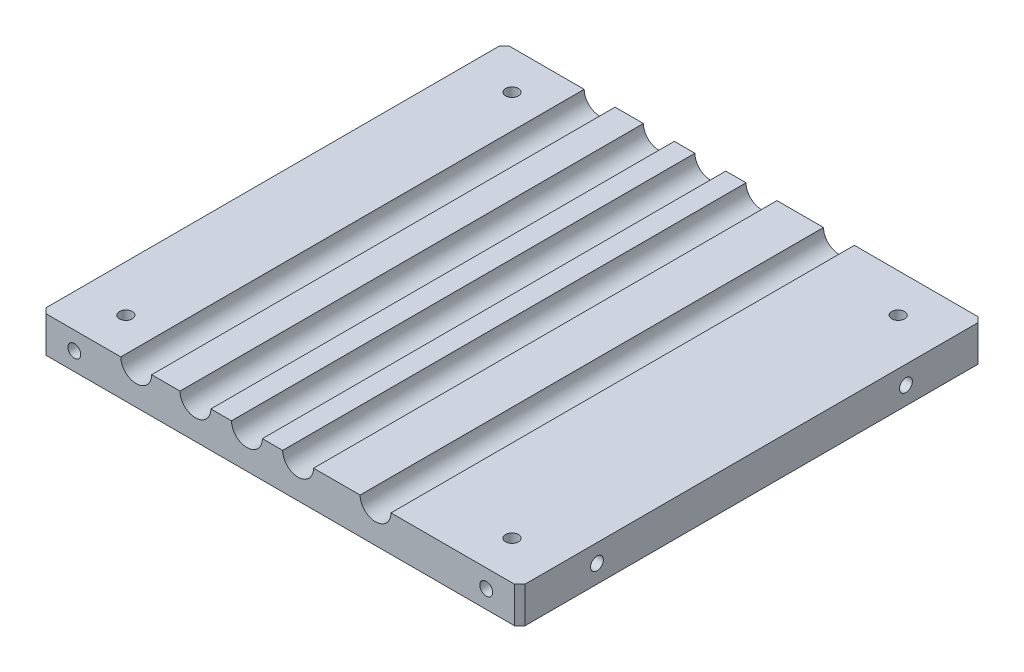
from build123d import *

# Parameters (mm, degrees)
SKETCH_1_W             = 93
SKETCH_1_H             = 90
EXTRUDE_1_DEPTH        = 7
CHAMFER_1_SIZE         = 1
SKETCH_2_R             = 3
CUT_EXTRUDE_1_DEPTH    = 102.544325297
HOLE_WIZARD_M3_1_D     = 2.5
HOLE_WIZARD_M3_2_D     = 2.5
HOLE_WIZARD_M3_2_DEPTH = 7.5
HOLE_WIZARD_M3_2_TIP   = 0.751075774
HOLE_WIZARD_M3_3_D     = 2.5
HOLE_WIZARD_M3_3_DEPTH = 7.5
HOLE_WIZARD_M3_3_TIP   = 0.751075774
HOLE_WIZARD_M3_5_D     = 2.5
HOLE_WIZARD_M3_5_DEPTH = 5
HOLE_WIZARD_M3_5_TIP   = 0.751075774
HOLE_WIZARD_M3_6_D     = 2.5
HOLE_WIZARD_M3_6_DEPTH = 6
HOLE_WIZARD_M3_6_TIP   = 0.751075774


with BuildPart() as part:
    # Sketch 1 → Extrude 1 (new body)
    with BuildSketch(Plane(origin=(0, 0, 0), x_dir=(1, 0, 0), z_dir=(0, 1, 0))):
        Rectangle(SKETCH_1_W, SKETCH_1_H)
    extrude(amount=EXTRUDE_1_DEPTH)

    # Chamfer 1
    chamfer_1_edges = [part.edges().sort_by_distance(p)[0] for p in [
        (46.5, 3.5, 45),
        (-46.5, 3.5, 45),
        (-46.5, 3.5, -45),
        (46.5, 3.5, -45),
    ]]
    chamfer(chamfer_1_edges, length=CHAMFER_1_SIZE)

    # Sketch 2 → Cut-Extrude 1 (cut, through all)
    with BuildSketch(Plane.XY.offset(45)):
        with Locations((18.493876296, 7)):
            Circle(SKETCH_2_R)
        with Locations((3.459690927, 6.983289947)):
            Circle(SKETCH_2_R)
        with Locations((-6.48, 7)):
            Circle(SKETCH_2_R)
        with Locations((-16.48, 7)):
            Circle(SKETCH_2_R)
        with Locations((-27.98, 7)):
            Circle(SKETCH_2_R)
    extrude(amount=-CUT_EXTRUDE_1_DEPTH, mode=Mode.SUBTRACT)

    # Hole Wizard M3 _1 (through all)
    with Locations(Plane(origin=(0, 0, 0), x_dir=(-1, 0, 0), z_dir=(0, -1, 0))):
        with Locations((37.5, 37.5), (-37.5, 37.5), (-37.5, -37.5), (37.5, -37.5)):
            Hole(HOLE_WIZARD_M3_1_D / 2)

    # Hole Wizard M3 _2
    with Locations(Plane(origin=(46.5, 0, 0), x_dir=(0, 0, -1), z_dir=(1, 0, 0))):
        with Locations((30, 3.5), (-30, 3.5)):
            Hole(HOLE_WIZARD_M3_2_D / 2, depth=HOLE_WIZARD_M3_2_DEPTH)
            with Locations((0, 0, -(HOLE_WIZARD_M3_2_DEPTH + HOLE_WIZARD_M3_2_TIP / 2))):  # 118° drill point
                Cone(0, HOLE_WIZARD_M3_2_D / 2, HOLE_WIZARD_M3_2_TIP, mode=Mode.SUBTRACT)

    # Hole Wizard M3 _3
    with Locations(Plane.ZY.offset(46.5)):
        with Locations((30, 3.5), (-30, 3.5)):
            Hole(HOLE_WIZARD_M3_3_D / 2, depth=HOLE_WIZARD_M3_3_DEPTH)
            with Locations((0, 0, -(HOLE_WIZARD_M3_3_DEPTH + HOLE_WIZARD_M3_3_TIP / 2))):  # 118° drill point
                Cone(0, HOLE_WIZARD_M3_3_D / 2, HOLE_WIZARD_M3_3_TIP, mode=Mode.SUBTRACT)

    # Hole Wizard M3 _5
    with Locations(Plane(origin=(0, 0, -45), x_dir=(-1, 0, 0), z_dir=(0, 0, -1))):
        with Locations((40, 3.5), (-40, 3.5)):
            Hole(HOLE_WIZARD_M3_5_D / 2, depth=HOLE_WIZARD_M3_5_DEPTH)
            with Locations((0, 0, -(HOLE_WIZARD_M3_5_DEPTH + HOLE_WIZARD_M3_5_TIP / 2))):  # 118° drill point
                Cone(0, HOLE_WIZARD_M3_5_D / 2, HOLE_WIZARD_M3_5_TIP, mode=Mode.SUBTRACT)

    # Hole Wizard M3 _6
    with Locations(Plane.XY.offset(45)):
        with Locations((40, 3.5), (-40, 3.5)):
            Hole(HOLE_WIZARD_M3_6_D / 2, depth=HOLE_WIZARD_M3_6_DEPTH)
            with Locations((0, 0, -(HOLE_WIZARD_M3_6_DEPTH + HOLE_WIZARD_M3_6_TIP / 2))):  # 118° drill point
                Cone(0, HOLE_WIZARD_M3_6_D / 2, HOLE_WIZARD_M3_6_TIP, mode=Mode.SUBTRACT)


solid = part.part
